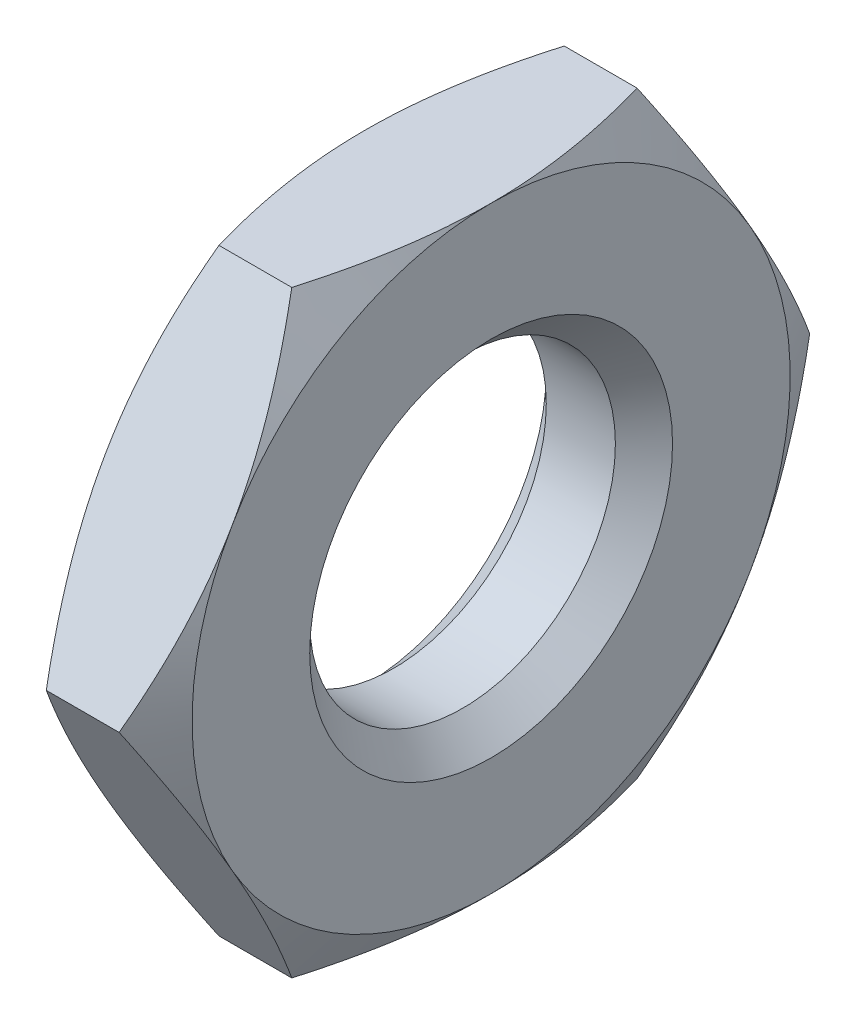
from build123d import *

# Parameters (mm, degrees)
SKETCH1_R      = 1.15
EXTRUDE1_DEPTH = 0.95
CHAMFER1_SIZE  = 0.215


with BuildPart() as part:
    # Sketch1 → Extrude1 (new body)
    with BuildSketch(Plane(origin=(0, 0, 0), x_dir=(0, 0, -1), z_dir=(1, 0, 0))):
        Polygon((1.299038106, 2.25), (-1.299038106, 2.25), (-2.598076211, 0), (-1.299038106, -2.25), (1.299038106, -2.25), (2.598076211, 0), align=None)
        with Locations(Location((0, 0, 0), (0, 0, 180))):
            Circle(SKETCH1_R, mode=Mode.SUBTRACT)
    extrude(amount=EXTRUDE1_DEPTH)

    # Sketch2 → Cut-Revolve1 (revolve, cut)
    with BuildSketch(Plane.XY):
        Polygon((0.95, 2.25), (0.95, 9), (0, 9), (0, 2.25), (0.475, 3.072724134), align=None)
    revolve(axis=Axis((0.95, 0, 0), (-1, 0, 0)), mode=Mode.SUBTRACT)

    # Chamfer1
    chamfer1_edges = [part.edges().sort_by_distance(p)[0] for p in [
        (0, 0, -1.15),
        (0.95, 0, -1.15),
    ]]
    chamfer(chamfer1_edges, length=CHAMFER1_SIZE)


solid = part.part
